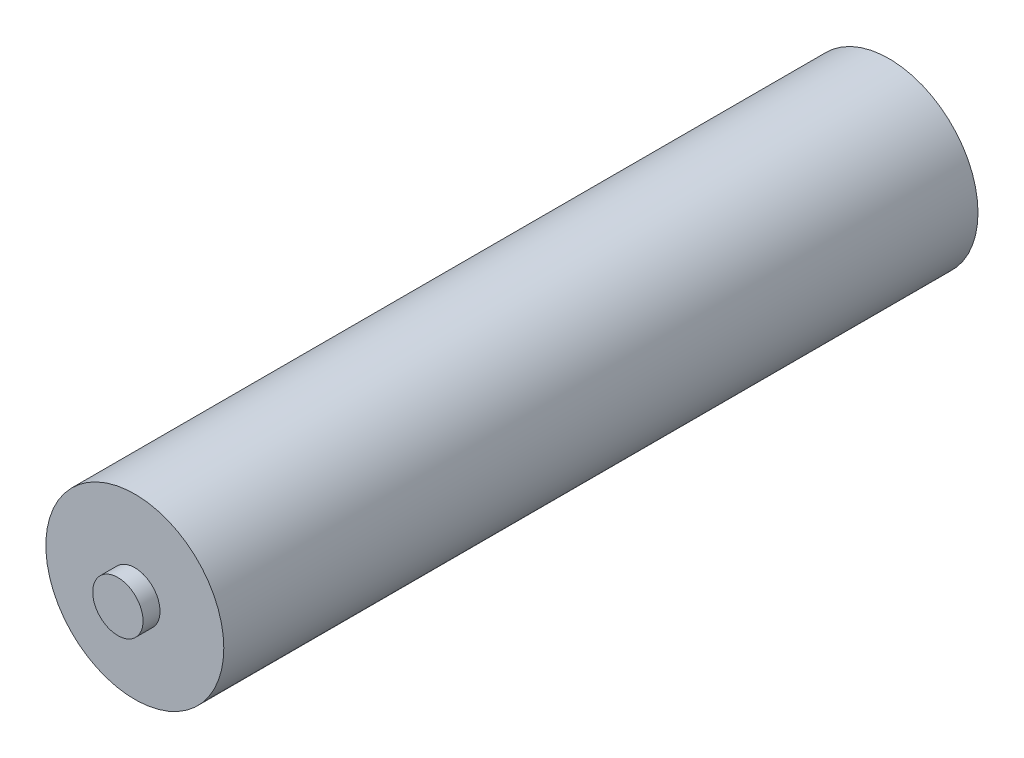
ISO-10303-21;
HEADER;
FILE_DESCRIPTION(('STEP AP214'),'2;1');
FILE_NAME('part.step','',(''),(''),'','','');
FILE_SCHEMA(('AUTOMOTIVE_DESIGN { 1 0 10303 214 1 1 1 1 }'));
ENDSEC;
DATA;
#1=APPLICATION_CONTEXT('core data for automotive mechanical design processes');
#2=APPLICATION_PROTOCOL_DEFINITION('international standard','automotive_design',2000,#1);
#3=PRODUCT_CONTEXT('',#1,'mechanical');
#4=PRODUCT('Part','Part','',(#3));
#5=PRODUCT_RELATED_PRODUCT_CATEGORY('part','',(#4));
#6=PRODUCT_DEFINITION_FORMATION('','',#4);
#7=PRODUCT_DEFINITION_CONTEXT('part definition',#1,'design');
#8=PRODUCT_DEFINITION('design','',#6,#7);
#9=PRODUCT_DEFINITION_SHAPE('','',#8);
#10=(LENGTH_UNIT() NAMED_UNIT(*) SI_UNIT(.MILLI.,.METRE.));
#11=(NAMED_UNIT(*) PLANE_ANGLE_UNIT() SI_UNIT($,.RADIAN.));
#12=(NAMED_UNIT(*) SI_UNIT($,.STERADIAN.) SOLID_ANGLE_UNIT());
#13=UNCERTAINTY_MEASURE_WITH_UNIT(LENGTH_MEASURE(1.E-05),#10,'distance_accuracy_value','');
#14=(GEOMETRIC_REPRESENTATION_CONTEXT(3) GLOBAL_UNCERTAINTY_ASSIGNED_CONTEXT((#13)) GLOBAL_UNIT_ASSIGNED_CONTEXT((#10,
#11,#12)) REPRESENTATION_CONTEXT('',''));
#15=CARTESIAN_POINT('',(0.,0.,0.));
#16=DIRECTION('',(0.,0.,1.));
#17=DIRECTION('',(1.,0.,0.));
#18=AXIS2_PLACEMENT_3D('',#15,#16,#17);
#19=CARTESIAN_POINT('',(0.,0.,44.5));
#20=DIRECTION('',(0.,0.,-1.));
#21=DIRECTION('',(-1.,0.,0.));
#22=AXIS2_PLACEMENT_3D('',#19,#20,#21);
#23=CYLINDRICAL_SURFACE('',#22,5.25);
#24=CARTESIAN_POINT('',(0.,0.,44.5));
#25=DIRECTION('',(0.,0.,1.));
#26=DIRECTION('',(1.,0.,0.));
#27=AXIS2_PLACEMENT_3D('',#24,#25,#26);
#28=CIRCLE('',#27,5.25);
#29=CARTESIAN_POINT('',(5.25,0.,44.5));
#30=VERTEX_POINT('',#29);
#31=EDGE_CURVE('E43',#30,#30,#28,.T.);
#32=ORIENTED_EDGE('',*,*,#31,.F.);
#33=EDGE_LOOP('',(#32));
#34=FACE_BOUND('',#33,.T.);
#35=CARTESIAN_POINT('',(0.,0.,0.));
#36=DIRECTION('',(0.,0.,1.));
#37=DIRECTION('',(1.,0.,0.));
#38=AXIS2_PLACEMENT_3D('',#35,#36,#37);
#39=CIRCLE('',#38,5.25);
#40=CARTESIAN_POINT('',(5.25,0.,0.));
#41=VERTEX_POINT('',#40);
#42=EDGE_CURVE('E39',#41,#41,#39,.T.);
#43=ORIENTED_EDGE('',*,*,#42,.T.);
#44=EDGE_LOOP('',(#43));
#45=FACE_BOUND('',#44,.T.);
#46=ADVANCED_FACE('F36',(#34,#45),#23,.T.);
#47=CARTESIAN_POINT('',(0.,0.,44.5));
#48=DIRECTION('',(0.,0.,1.));
#49=DIRECTION('',(1.,0.,0.));
#50=AXIS2_PLACEMENT_3D('',#47,#48,#49);
#51=PLANE('',#50);
#52=CARTESIAN_POINT('',(0.,0.,44.5));
#53=DIRECTION('',(0.,0.,1.));
#54=DIRECTION('',(1.,0.,0.));
#55=AXIS2_PLACEMENT_3D('',#52,#53,#54);
#56=CIRCLE('',#55,1.48470679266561);
#57=CARTESIAN_POINT('',(1.48470679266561,0.,44.5));
#58=VERTEX_POINT('',#57);
#59=EDGE_CURVE('E10',#58,#58,#56,.T.);
#60=ORIENTED_EDGE('',*,*,#59,.F.);
#61=EDGE_LOOP('',(#60));
#62=FACE_BOUND('',#61,.T.);
#63=ORIENTED_EDGE('',*,*,#31,.T.);
#64=EDGE_LOOP('',(#63));
#65=FACE_BOUND('',#64,.T.);
#66=ADVANCED_FACE('F60',(#62,#65),#51,.T.);
#67=CARTESIAN_POINT('',(0.,0.,0.));
#68=DIRECTION('',(0.,0.,1.));
#69=DIRECTION('',(1.,0.,0.));
#70=AXIS2_PLACEMENT_3D('',#67,#68,#69);
#71=PLANE('',#70);
#72=ORIENTED_EDGE('',*,*,#42,.F.);
#73=EDGE_LOOP('',(#72));
#74=FACE_BOUND('',#73,.T.);
#75=ADVANCED_FACE('F57',(#74),#71,.F.);
#76=CARTESIAN_POINT('',(0.,0.,45.5));
#77=DIRECTION('',(0.,0.,-1.));
#78=DIRECTION('',(-1.,0.,0.));
#79=AXIS2_PLACEMENT_3D('',#76,#77,#78);
#80=CYLINDRICAL_SURFACE('',#79,1.48470679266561);
#81=CARTESIAN_POINT('',(0.,0.,45.5));
#82=DIRECTION('',(0.,0.,1.));
#83=DIRECTION('',(1.,0.,0.));
#84=AXIS2_PLACEMENT_3D('',#81,#82,#83);
#85=CIRCLE('',#84,1.48470679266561);
#86=CARTESIAN_POINT('',(1.48470679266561,0.,45.5));
#87=VERTEX_POINT('',#86);
#88=EDGE_CURVE('E49',#87,#87,#85,.T.);
#89=ORIENTED_EDGE('',*,*,#88,.F.);
#90=EDGE_LOOP('',(#89));
#91=FACE_BOUND('',#90,.T.);
#92=ORIENTED_EDGE('',*,*,#59,.T.);
#93=EDGE_LOOP('',(#92));
#94=FACE_BOUND('',#93,.T.);
#95=ADVANCED_FACE('F59',(#91,#94),#80,.T.);
#96=CARTESIAN_POINT('',(0.,0.,45.5));
#97=DIRECTION('',(0.,0.,1.));
#98=DIRECTION('',(1.,0.,0.));
#99=AXIS2_PLACEMENT_3D('',#96,#97,#98);
#100=PLANE('',#99);
#101=ORIENTED_EDGE('',*,*,#88,.T.);
#102=EDGE_LOOP('',(#101));
#103=FACE_BOUND('',#102,.T.);
#104=ADVANCED_FACE('F65',(#103),#100,.T.);
#105=CLOSED_SHELL('',(#46,#66,#75,#95,#104));
#106=MANIFOLD_SOLID_BREP('B2',#105);
#107=ADVANCED_BREP_SHAPE_REPRESENTATION('',(#18,#106),#14);
#108=SHAPE_DEFINITION_REPRESENTATION(#9,#107);
ENDSEC;
END-ISO-10303-21;
